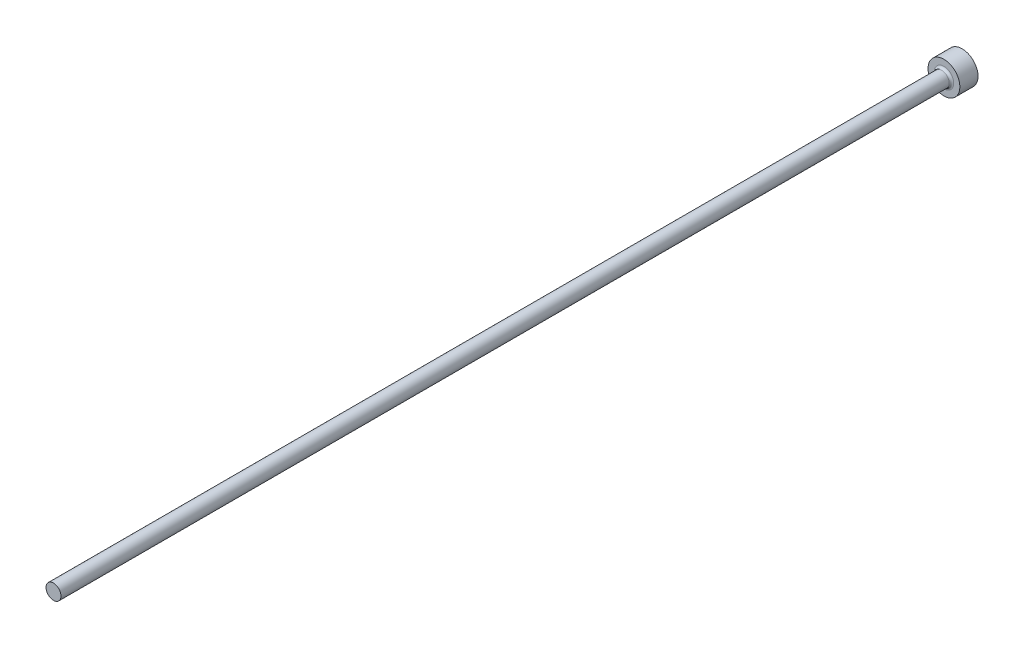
ISO-10303-21;
HEADER;
FILE_DESCRIPTION(('STEP AP214'),'2;1');
FILE_NAME('part.step','',(''),(''),'','','');
FILE_SCHEMA(('AUTOMOTIVE_DESIGN { 1 0 10303 214 1 1 1 1 }'));
ENDSEC;
DATA;
#1=APPLICATION_CONTEXT('core data for automotive mechanical design processes');
#2=APPLICATION_PROTOCOL_DEFINITION('international standard','automotive_design',2000,#1);
#3=PRODUCT_CONTEXT('',#1,'mechanical');
#4=PRODUCT('Part','Part','',(#3));
#5=PRODUCT_RELATED_PRODUCT_CATEGORY('part','',(#4));
#6=PRODUCT_DEFINITION_FORMATION('','',#4);
#7=PRODUCT_DEFINITION_CONTEXT('part definition',#1,'design');
#8=PRODUCT_DEFINITION('design','',#6,#7);
#9=PRODUCT_DEFINITION_SHAPE('','',#8);
#10=(LENGTH_UNIT() NAMED_UNIT(*) SI_UNIT(.MILLI.,.METRE.));
#11=(NAMED_UNIT(*) PLANE_ANGLE_UNIT() SI_UNIT($,.RADIAN.));
#12=(NAMED_UNIT(*) SI_UNIT($,.STERADIAN.) SOLID_ANGLE_UNIT());
#13=UNCERTAINTY_MEASURE_WITH_UNIT(LENGTH_MEASURE(1.E-05),#10,'distance_accuracy_value','');
#14=(GEOMETRIC_REPRESENTATION_CONTEXT(3) GLOBAL_UNCERTAINTY_ASSIGNED_CONTEXT((#13)) GLOBAL_UNIT_ASSIGNED_CONTEXT((#10,
#11,#12)) REPRESENTATION_CONTEXT('',''));
#15=CARTESIAN_POINT('',(0.,0.,0.));
#16=DIRECTION('',(0.,0.,1.));
#17=DIRECTION('',(1.,0.,0.));
#18=AXIS2_PLACEMENT_3D('',#15,#16,#17);
#19=CARTESIAN_POINT('',(3.5,0.,4.));
#20=DIRECTION('',(0.,0.,-1.));
#21=DIRECTION('',(-1.,0.,0.));
#22=AXIS2_PLACEMENT_3D('',#19,#20,#21);
#23=PLANE('',#22);
#24=CARTESIAN_POINT('',(0.,0.,4.));
#25=DIRECTION('',(0.,0.,-1.));
#26=DIRECTION('',(-1.,0.,0.));
#27=AXIS2_PLACEMENT_3D('',#24,#25,#26);
#28=CIRCLE('',#27,2.15000000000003);
#29=CARTESIAN_POINT('',(-2.15000000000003,0.,4.));
#30=VERTEX_POINT('',#29);
#31=EDGE_CURVE('E40',#30,#30,#28,.T.);
#32=ORIENTED_EDGE('',*,*,#31,.T.);
#33=EDGE_LOOP('',(#32));
#34=FACE_BOUND('',#33,.T.);
#35=CARTESIAN_POINT('',(0.,0.,4.));
#36=DIRECTION('',(0.,0.,-1.));
#37=DIRECTION('',(-1.,0.,0.));
#38=AXIS2_PLACEMENT_3D('',#35,#36,#37);
#39=CIRCLE('',#38,3.5);
#40=CARTESIAN_POINT('',(-3.5,0.,4.));
#41=VERTEX_POINT('',#40);
#42=EDGE_CURVE('E44',#41,#41,#39,.T.);
#43=ORIENTED_EDGE('',*,*,#42,.F.);
#44=EDGE_LOOP('',(#43));
#45=FACE_BOUND('',#44,.T.);
#46=ADVANCED_FACE('F33',(#34,#45),#23,.F.);
#47=CARTESIAN_POINT('',(0.,0.,-9.03322817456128));
#48=DIRECTION('',(0.,0.,-1.));
#49=DIRECTION('',(-1.,0.,0.));
#50=AXIS2_PLACEMENT_3D('',#47,#48,#49);
#51=CYLINDRICAL_SURFACE('',#50,3.5);
#52=CARTESIAN_POINT('',(0.,0.,0.));
#53=DIRECTION('',(0.,0.,-1.));
#54=DIRECTION('',(-1.,0.,0.));
#55=AXIS2_PLACEMENT_3D('',#52,#53,#54);
#56=CIRCLE('',#55,3.5);
#57=CARTESIAN_POINT('',(-3.5,0.,0.));
#58=VERTEX_POINT('',#57);
#59=EDGE_CURVE('E48',#58,#58,#56,.T.);
#60=ORIENTED_EDGE('',*,*,#59,.F.);
#61=EDGE_LOOP('',(#60));
#62=FACE_BOUND('',#61,.T.);
#63=ORIENTED_EDGE('',*,*,#42,.T.);
#64=EDGE_LOOP('',(#63));
#65=FACE_BOUND('',#64,.T.);
#66=ADVANCED_FACE('F68',(#62,#65),#51,.T.);
#67=CARTESIAN_POINT('',(0.,0.,0.));
#68=DIRECTION('',(0.,0.,1.));
#69=DIRECTION('',(1.,0.,0.));
#70=AXIS2_PLACEMENT_3D('',#67,#68,#69);
#71=PLANE('',#70);
#72=ORIENTED_EDGE('',*,*,#59,.T.);
#73=EDGE_LOOP('',(#72));
#74=FACE_BOUND('',#73,.T.);
#75=ADVANCED_FACE('F61',(#74),#71,.F.);
#76=CARTESIAN_POINT('',(0.,0.,200.));
#77=DIRECTION('',(0.,0.,-1.));
#78=DIRECTION('',(-1.,0.,0.));
#79=AXIS2_PLACEMENT_3D('',#76,#77,#78);
#80=PLANE('',#79);
#81=CARTESIAN_POINT('',(0.,0.,200.));
#82=DIRECTION('',(0.,0.,-1.));
#83=DIRECTION('',(-1.,0.,0.));
#84=AXIS2_PLACEMENT_3D('',#81,#82,#83);
#85=CIRCLE('',#84,1.65000000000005);
#86=CARTESIAN_POINT('',(-1.65000000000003,0.,200.));
#87=VERTEX_POINT('',#86);
#88=EDGE_CURVE('E53',#87,#87,#85,.T.);
#89=ORIENTED_EDGE('',*,*,#88,.F.);
#90=EDGE_LOOP('',(#89));
#91=FACE_BOUND('',#90,.T.);
#92=ADVANCED_FACE('F59',(#91),#80,.F.);
#93=CARTESIAN_POINT('',(0.,0.,-9.03322817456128));
#94=DIRECTION('',(0.,0.,-1.));
#95=DIRECTION('',(-1.,0.,0.));
#96=AXIS2_PLACEMENT_3D('',#93,#94,#95);
#97=CYLINDRICAL_SURFACE('',#96,1.65000000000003);
#98=CARTESIAN_POINT('',(0.,0.,4.5));
#99=DIRECTION('',(0.,0.,-1.));
#100=DIRECTION('',(-1.,0.,0.));
#101=AXIS2_PLACEMENT_3D('',#98,#99,#100);
#102=CIRCLE('',#101,1.65000000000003);
#103=CARTESIAN_POINT('',(-1.65000000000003,0.,4.5));
#104=VERTEX_POINT('',#103);
#105=EDGE_CURVE('E10',#104,#104,#102,.F.);
#106=ORIENTED_EDGE('',*,*,#105,.T.);
#107=EDGE_LOOP('',(#106));
#108=FACE_BOUND('',#107,.T.);
#109=ORIENTED_EDGE('',*,*,#88,.T.);
#110=EDGE_LOOP('',(#109));
#111=FACE_BOUND('',#110,.T.);
#112=ADVANCED_FACE('F57',(#108,#111),#97,.T.);
#113=CARTESIAN_POINT('',(0.,0.,4.5));
#114=DIRECTION('',(0.,0.,-1.));
#115=DIRECTION('',(-1.,0.,0.));
#116=AXIS2_PLACEMENT_3D('',#113,#114,#115);
#117=TOROIDAL_SURFACE('',#116,2.15000000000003,0.5);
#118=ORIENTED_EDGE('',*,*,#105,.F.);
#119=EDGE_LOOP('',(#118));
#120=FACE_BOUND('',#119,.T.);
#121=ORIENTED_EDGE('',*,*,#31,.F.);
#122=EDGE_LOOP('',(#121));
#123=FACE_BOUND('',#122,.T.);
#124=ADVANCED_FACE('F35',(#120,#123),#117,.F.);
#125=CLOSED_SHELL('',(#46,#66,#75,#92,#112,#124));
#126=MANIFOLD_SOLID_BREP('B2',#125);
#127=ADVANCED_BREP_SHAPE_REPRESENTATION('',(#18,#126),#14);
#128=SHAPE_DEFINITION_REPRESENTATION(#9,#127);
ENDSEC;
END-ISO-10303-21;
